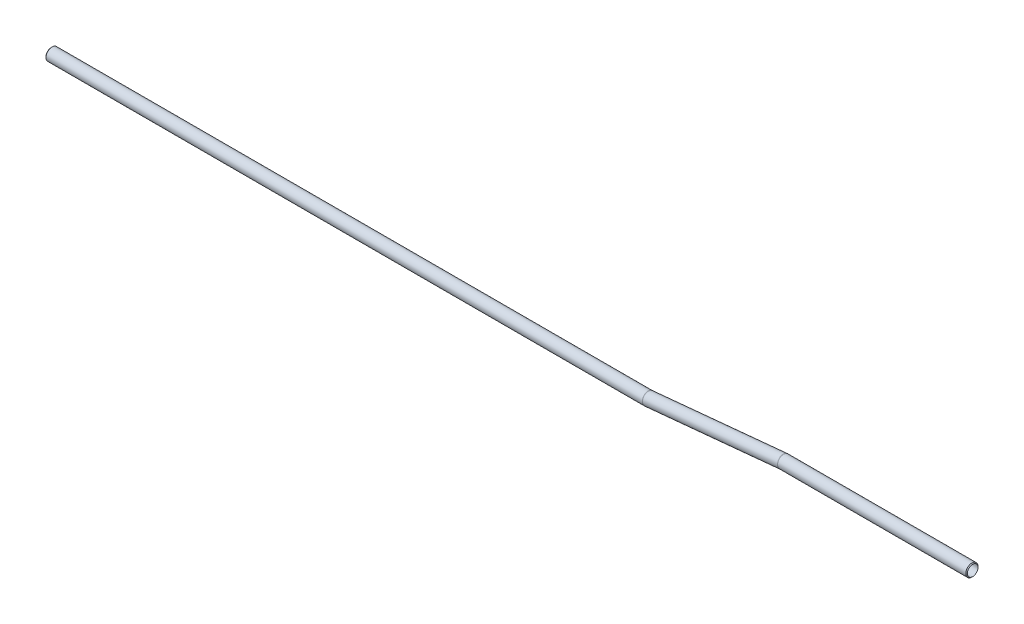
ISO-10303-21;
HEADER;
FILE_DESCRIPTION(('STEP AP214'),'2;1');
FILE_NAME('part.step','',(''),(''),'','','');
FILE_SCHEMA(('AUTOMOTIVE_DESIGN { 1 0 10303 214 1 1 1 1 }'));
ENDSEC;
DATA;
#1=APPLICATION_CONTEXT('core data for automotive mechanical design processes');
#2=APPLICATION_PROTOCOL_DEFINITION('international standard','automotive_design',2000,#1);
#3=PRODUCT_CONTEXT('',#1,'mechanical');
#4=PRODUCT('Part','Part','',(#3));
#5=PRODUCT_RELATED_PRODUCT_CATEGORY('part','',(#4));
#6=PRODUCT_DEFINITION_FORMATION('','',#4);
#7=PRODUCT_DEFINITION_CONTEXT('part definition',#1,'design');
#8=PRODUCT_DEFINITION('design','',#6,#7);
#9=PRODUCT_DEFINITION_SHAPE('','',#8);
#10=(LENGTH_UNIT() NAMED_UNIT(*) SI_UNIT(.MILLI.,.METRE.));
#11=(NAMED_UNIT(*) PLANE_ANGLE_UNIT() SI_UNIT($,.RADIAN.));
#12=(NAMED_UNIT(*) SI_UNIT($,.STERADIAN.) SOLID_ANGLE_UNIT());
#13=UNCERTAINTY_MEASURE_WITH_UNIT(LENGTH_MEASURE(1.E-05),#10,'distance_accuracy_value','');
#14=(GEOMETRIC_REPRESENTATION_CONTEXT(3) GLOBAL_UNCERTAINTY_ASSIGNED_CONTEXT((#13)) GLOBAL_UNIT_ASSIGNED_CONTEXT((#10,
#11,#12)) REPRESENTATION_CONTEXT('',''));
#15=CARTESIAN_POINT('',(0.,0.,0.));
#16=DIRECTION('',(0.,0.,1.));
#17=DIRECTION('',(1.,0.,0.));
#18=AXIS2_PLACEMENT_3D('',#15,#16,#17);
#19=CARTESIAN_POINT('',(-117.096200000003,-5.48204999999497,0.));
#20=DIRECTION('',(-1.,0.,0.));
#21=DIRECTION('',(0.,0.,1.));
#22=AXIS2_PLACEMENT_3D('',#19,#20,#21);
#23=CYLINDRICAL_SURFACE('',#22,2.58475);
#24=CARTESIAN_POINT('',(-369.096200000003,-5.48204999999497,0.));
#25=DIRECTION('',(-1.,0.,0.));
#26=DIRECTION('',(0.,0.,1.));
#27=AXIS2_PLACEMENT_3D('',#24,#25,#26);
#28=CIRCLE('',#27,2.58475);
#29=CARTESIAN_POINT('',(-369.096200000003,-5.48204999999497,2.58475));
#30=VERTEX_POINT('',#29);
#31=EDGE_CURVE('E156',#30,#30,#28,.F.);
#32=ORIENTED_EDGE('',*,*,#31,.T.);
#33=EDGE_LOOP('',(#32));
#34=FACE_BOUND('',#33,.T.);
#35=CARTESIAN_POINT('',(-117.096200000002,-5.48204999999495,0.));
#36=DIRECTION('',(0.996410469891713,0.0846532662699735,0.));
#37=DIRECTION('',(0.0846532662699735,-0.996410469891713,0.));
#38=AXIS2_PLACEMENT_3D('',#35,#36,#37);
#39=ELLIPSE('',#38,2.59406146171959,2.58475);
#40=CARTESIAN_POINT('',(-117.096200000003,-5.48204999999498,2.58475));
#41=VERTEX_POINT('',#40);
#42=CARTESIAN_POINT('',(-117.096200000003,-5.48204999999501,-2.58475));
#43=VERTEX_POINT('',#42);
#44=EDGE_CURVE('E50',#41,#43,#39,.F.);
#45=ORIENTED_EDGE('',*,*,#44,.T.);
#46=CARTESIAN_POINT('',(-117.096200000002,-5.48204999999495,0.));
#47=DIRECTION('',(0.999941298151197,0.0108351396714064,0.));
#48=DIRECTION('',(0.0108351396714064,-0.999941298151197,0.));
#49=AXIS2_PLACEMENT_3D('',#46,#47,#48);
#50=ELLIPSE('',#49,2.58490173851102,2.58475);
#51=EDGE_CURVE('E12',#43,#41,#50,.F.);
#52=ORIENTED_EDGE('',*,*,#51,.T.);
#53=EDGE_LOOP('',(#45,#52));
#54=FACE_BOUND('',#53,.T.);
#55=ADVANCED_FACE('F37',(#34,#54),#23,.T.);
#56=CARTESIAN_POINT('',(-117.096200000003,-5.48204999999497,0.));
#57=DIRECTION('',(-1.,0.,0.));
#58=DIRECTION('',(0.,0.,1.));
#59=AXIS2_PLACEMENT_3D('',#56,#57,#58);
#60=CYLINDRICAL_SURFACE('',#59,2.25);
#61=CARTESIAN_POINT('',(-369.430950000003,-5.48204999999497,0.));
#62=DIRECTION('',(1.,0.,0.));
#63=DIRECTION('',(0.,0.,-1.));
#64=AXIS2_PLACEMENT_3D('',#61,#62,#63);
#65=CIRCLE('',#64,2.25);
#66=CARTESIAN_POINT('',(-369.430950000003,-5.48204999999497,-2.25));
#67=VERTEX_POINT('',#66);
#68=EDGE_CURVE('E158',#67,#67,#65,.F.);
#69=ORIENTED_EDGE('',*,*,#68,.T.);
#70=EDGE_LOOP('',(#69));
#71=FACE_BOUND('',#70,.T.);
#72=CARTESIAN_POINT('',(-117.096200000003,-5.48204999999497,0.));
#73=DIRECTION('',(-0.998854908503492,-0.0478421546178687,0.));
#74=DIRECTION('',(0.0478421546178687,-0.998854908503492,0.));
#75=AXIS2_PLACEMENT_3D('',#72,#73,#74);
#76=ELLIPSE('',#75,2.25257940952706,2.25);
#77=CARTESIAN_POINT('',(-116.988431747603,-7.73204999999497,0.));
#78=VERTEX_POINT('',#77);
#79=EDGE_CURVE('E161',#78,#78,#76,.F.);
#80=ORIENTED_EDGE('',*,*,#79,.T.);
#81=EDGE_LOOP('',(#80));
#82=FACE_BOUND('',#81,.T.);
#83=ADVANCED_FACE('F118',(#71,#82),#60,.F.);
#84=CARTESIAN_POINT('',(-60.0000000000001,0.,0.));
#85=DIRECTION('',(-0.99542225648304,-0.0955747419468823,0.));
#86=DIRECTION('',(0.0955747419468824,-0.99542225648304,0.));
#87=AXIS2_PLACEMENT_3D('',#84,#85,#86);
#88=CYLINDRICAL_SURFACE('',#87,2.25);
#89=CARTESIAN_POINT('',(-60.0000000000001,0.,0.));
#90=DIRECTION('',(-0.998854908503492,-0.0478421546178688,0.));
#91=DIRECTION('',(-0.0478421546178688,0.998854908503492,0.));
#92=AXIS2_PLACEMENT_3D('',#89,#90,#91);
#93=ELLIPSE('',#92,2.25257940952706,2.25);
#94=CARTESIAN_POINT('',(-60.1077682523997,2.24999999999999,0.));
#95=VERTEX_POINT('',#94);
#96=EDGE_CURVE('E162',#95,#95,#93,.T.);
#97=ORIENTED_EDGE('',*,*,#96,.F.);
#98=EDGE_LOOP('',(#97));
#99=FACE_BOUND('',#98,.T.);
#100=ORIENTED_EDGE('',*,*,#79,.F.);
#101=EDGE_LOOP('',(#100));
#102=FACE_BOUND('',#101,.T.);
#103=ADVANCED_FACE('F115',(#99,#102),#88,.F.);
#104=CARTESIAN_POINT('',(-60.0000000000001,0.,0.));
#105=DIRECTION('',(-0.99542225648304,-0.0955747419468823,0.));
#106=DIRECTION('',(0.0955747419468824,-0.99542225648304,0.));
#107=AXIS2_PLACEMENT_3D('',#104,#105,#106);
#108=CYLINDRICAL_SURFACE('',#107,2.58475);
#109=CARTESIAN_POINT('',(-60.0000000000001,0.,0.));
#110=DIRECTION('',(0.996399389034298,0.084783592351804,0.));
#111=DIRECTION('',(0.084783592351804,-0.996399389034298,0.));
#112=AXIS2_PLACEMENT_3D('',#109,#110,#111);
#113=ELLIPSE('',#112,2.58490173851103,2.58475);
#114=CARTESIAN_POINT('',(-60.0000000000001,0.,2.58475));
#115=VERTEX_POINT('',#114);
#116=CARTESIAN_POINT('',(-60.0000000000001,0.,-2.58475));
#117=VERTEX_POINT('',#116);
#118=EDGE_CURVE('E73',#115,#117,#113,.F.);
#119=ORIENTED_EDGE('',*,*,#118,.T.);
#120=CARTESIAN_POINT('',(-60.0000000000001,0.,0.));
#121=DIRECTION('',(0.999939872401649,0.0109659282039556,0.));
#122=DIRECTION('',(0.0109659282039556,-0.999939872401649,0.));
#123=AXIS2_PLACEMENT_3D('',#120,#121,#122);
#124=ELLIPSE('',#123,2.59406146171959,2.58475);
#125=EDGE_CURVE('E81',#117,#115,#124,.F.);
#126=ORIENTED_EDGE('',*,*,#125,.T.);
#127=EDGE_LOOP('',(#119,#126));
#128=FACE_BOUND('',#127,.T.);
#129=CARTESIAN_POINT('',(-117.096200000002,-5.48204999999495,0.));
#130=DIRECTION('',(0.996399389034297,0.084783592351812,0.));
#131=DIRECTION('',(0.0847835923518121,-0.996399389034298,0.));
#132=AXIS2_PLACEMENT_3D('',#129,#130,#131);
#133=ELLIPSE('',#132,2.58490173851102,2.58475);
#134=EDGE_CURVE('E147',#41,#43,#133,.T.);
#135=ORIENTED_EDGE('',*,*,#134,.T.);
#136=CARTESIAN_POINT('',(-117.096200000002,-5.48204999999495,0.));
#137=DIRECTION('',(0.999939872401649,0.0109659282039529,0.));
#138=DIRECTION('',(0.0109659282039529,-0.999939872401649,0.));
#139=AXIS2_PLACEMENT_3D('',#136,#137,#138);
#140=ELLIPSE('',#139,2.59406146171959,2.58475);
#141=EDGE_CURVE('E86',#43,#41,#140,.T.);
#142=ORIENTED_EDGE('',*,*,#141,.T.);
#143=EDGE_LOOP('',(#135,#142));
#144=FACE_BOUND('',#143,.T.);
#145=ADVANCED_FACE('F84',(#128,#144),#108,.T.);
#146=CARTESIAN_POINT('',(0.,0.,0.));
#147=DIRECTION('',(-1.,0.,0.));
#148=DIRECTION('',(0.,-1.,0.));
#149=AXIS2_PLACEMENT_3D('',#146,#147,#148);
#150=CYLINDRICAL_SURFACE('',#149,2.25);
#151=CARTESIAN_POINT('',(19.8347499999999,0.,0.));
#152=DIRECTION('',(-1.,0.,0.));
#153=DIRECTION('',(0.,-1.,0.));
#154=AXIS2_PLACEMENT_3D('',#151,#152,#153);
#155=CIRCLE('',#154,2.25);
#156=CARTESIAN_POINT('',(19.8347499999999,-2.25,0.));
#157=VERTEX_POINT('',#156);
#158=EDGE_CURVE('E153',#157,#157,#155,.F.);
#159=ORIENTED_EDGE('',*,*,#158,.T.);
#160=EDGE_LOOP('',(#159));
#161=FACE_BOUND('',#160,.T.);
#162=ORIENTED_EDGE('',*,*,#96,.T.);
#163=EDGE_LOOP('',(#162));
#164=FACE_BOUND('',#163,.T.);
#165=ADVANCED_FACE('F113',(#161,#164),#150,.F.);
#166=CARTESIAN_POINT('',(0.,0.,0.));
#167=DIRECTION('',(-1.,0.,0.));
#168=DIRECTION('',(0.,-1.,0.));
#169=AXIS2_PLACEMENT_3D('',#166,#167,#168);
#170=CYLINDRICAL_SURFACE('',#169,2.58475);
#171=CARTESIAN_POINT('',(19.4999999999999,0.,0.));
#172=DIRECTION('',(1.,0.,0.));
#173=DIRECTION('',(0.,1.,0.));
#174=AXIS2_PLACEMENT_3D('',#171,#172,#173);
#175=CIRCLE('',#174,2.58475);
#176=CARTESIAN_POINT('',(19.4999999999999,2.58475,0.));
#177=VERTEX_POINT('',#176);
#178=EDGE_CURVE('E148',#177,#177,#175,.F.);
#179=ORIENTED_EDGE('',*,*,#178,.T.);
#180=EDGE_LOOP('',(#179));
#181=FACE_BOUND('',#180,.T.);
#182=CARTESIAN_POINT('',(-60.0000000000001,0.,0.));
#183=DIRECTION('',(0.996410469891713,0.0846532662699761,0.));
#184=DIRECTION('',(0.0846532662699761,-0.996410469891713,0.));
#185=AXIS2_PLACEMENT_3D('',#182,#183,#184);
#186=ELLIPSE('',#185,2.59406146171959,2.58475);
#187=EDGE_CURVE('E76',#115,#117,#186,.T.);
#188=ORIENTED_EDGE('',*,*,#187,.T.);
#189=CARTESIAN_POINT('',(-60.0000000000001,0.,0.));
#190=DIRECTION('',(0.999941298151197,0.0108351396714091,0.));
#191=DIRECTION('',(0.0108351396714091,-0.999941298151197,0.));
#192=AXIS2_PLACEMENT_3D('',#189,#190,#191);
#193=ELLIPSE('',#192,2.58490173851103,2.58475);
#194=EDGE_CURVE('E69',#117,#115,#193,.T.);
#195=ORIENTED_EDGE('',*,*,#194,.T.);
#196=EDGE_LOOP('',(#188,#195));
#197=FACE_BOUND('',#196,.T.);
#198=ADVANCED_FACE('F78',(#181,#197),#170,.T.);
#199=CARTESIAN_POINT('',(-369.596200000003,-5.48204999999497,0.));
#200=DIRECTION('',(1.,0.,0.));
#201=DIRECTION('',(0.,0.,-1.));
#202=AXIS2_PLACEMENT_3D('',#199,#200,#201);
#203=CONICAL_SURFACE('',#202,2.08474999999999,0.785398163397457);
#204=ORIENTED_EDGE('',*,*,#31,.F.);
#205=EDGE_LOOP('',(#204));
#206=FACE_BOUND('',#205,.T.);
#207=ORIENTED_EDGE('',*,*,#68,.F.);
#208=EDGE_LOOP('',(#207));
#209=FACE_BOUND('',#208,.T.);
#210=ADVANCED_FACE('F112',(#206,#209),#203,.T.);
#211=CARTESIAN_POINT('',(19.9999999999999,0.,0.));
#212=DIRECTION('',(-1.,0.,0.));
#213=DIRECTION('',(0.,-1.,0.));
#214=AXIS2_PLACEMENT_3D('',#211,#212,#213);
#215=CONICAL_SURFACE('',#214,2.08474999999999,0.785398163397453);
#216=ORIENTED_EDGE('',*,*,#178,.F.);
#217=EDGE_LOOP('',(#216));
#218=FACE_BOUND('',#217,.T.);
#219=ORIENTED_EDGE('',*,*,#158,.F.);
#220=EDGE_LOOP('',(#219));
#221=FACE_BOUND('',#220,.T.);
#222=ADVANCED_FACE('F103',(#218,#221),#215,.T.);
#223=CARTESIAN_POINT('',(-60.0000000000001,0.,-2.58475));
#224=CARTESIAN_POINT('',(-60.0000000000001,0.,-2.58475));
#225=CARTESIAN_POINT('',(-60.0000000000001,0.,-2.58475));
#226=CARTESIAN_POINT('',(-59.9987587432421,-0.113185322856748,-2.58479465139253));
#227=CARTESIAN_POINT('',(-59.9945882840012,-0.112986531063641,-2.58479669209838));
#228=CARTESIAN_POINT('',(-59.9904179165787,-0.112785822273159,-2.58479465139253));
#229=CARTESIAN_POINT('',(-59.997517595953,-0.226360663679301,-2.57737011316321));
#230=CARTESIAN_POINT('',(-59.9891770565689,-0.22596286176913,-2.57734394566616));
#231=CARTESIAN_POINT('',(-59.9808366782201,-0.225561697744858,-2.57737011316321));
#232=CARTESIAN_POINT('',(-59.9950564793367,-0.450780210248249,-2.54790466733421));
#233=CARTESIAN_POINT('',(-59.9784479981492,-0.449965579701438,-2.54777579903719));
#234=CARTESIAN_POINT('',(-59.9618376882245,-0.449189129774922,-2.54790466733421));
#235=CARTESIAN_POINT('',(-59.9938365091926,-0.562024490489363,-2.52586432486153));
#236=CARTESIAN_POINT('',(-59.9731300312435,-0.560994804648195,-2.52566021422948));
#237=CARTESIAN_POINT('',(-59.9524199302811,-0.560040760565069,-2.52586432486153));
#238=CARTESIAN_POINT('',(-59.9914386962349,-0.780671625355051,-2.46749141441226));
#239=CARTESIAN_POINT('',(-59.9626796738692,-0.779178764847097,-2.46710157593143));
#240=CARTESIAN_POINT('',(-59.9339096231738,-0.77791615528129,-2.46749141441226));
#241=CARTESIAN_POINT('',(-59.9902608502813,-0.888074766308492,-2.4311599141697));
#242=CARTESIAN_POINT('',(-59.9575471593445,-0.88633609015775,-2.43065820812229));
#243=CARTESIAN_POINT('',(-59.9248170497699,-0.884940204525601,-2.4311599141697));
#244=CARTESIAN_POINT('',(-59.9879674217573,-1.09720349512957,-2.34483988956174));
#245=CARTESIAN_POINT('',(-59.9475559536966,-1.09493381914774,-2.34409940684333));
#246=CARTESIAN_POINT('',(-59.9071125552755,-1.09333078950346,-2.34483988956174));
#247=CARTESIAN_POINT('',(-59.9868518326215,-1.19892968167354,-2.29485280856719));
#248=CARTESIAN_POINT('',(-59.9426971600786,-1.19637636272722,-2.29398364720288));
#249=CARTESIAN_POINT('',(-59.8985005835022,-1.19469792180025,-2.29485280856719));
#250=CARTESIAN_POINT('',(-59.9847020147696,-1.39496311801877,-2.18207281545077));
#251=CARTESIAN_POINT('',(-59.9333367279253,-1.39180471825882,-2.18095374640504));
#252=CARTESIAN_POINT('',(-59.8819047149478,-1.39003943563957,-2.18207281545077));
#253=CARTESIAN_POINT('',(-59.9836677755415,-1.48927132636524,-2.11928156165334));
#254=CARTESIAN_POINT('',(-59.9288350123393,-1.48579213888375,-2.11803940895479));
#255=CARTESIAN_POINT('',(-59.8739207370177,-1.48401477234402,-2.11928156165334));
#256=CARTESIAN_POINT('',(-59.9816983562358,-1.66885492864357,-1.98196844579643));
#257=CARTESIAN_POINT('',(-59.9202655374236,-1.66470678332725,-1.98050989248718));
#258=CARTESIAN_POINT('',(-59.8587174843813,-1.6629645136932,-1.98196844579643));
#259=CARTESIAN_POINT('',(-59.9807631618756,-1.75413162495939,-1.9074482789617));
#260=CARTESIAN_POINT('',(-59.9161977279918,-1.74963505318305,-1.90589480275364));
#261=CARTESIAN_POINT('',(-59.8514980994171,-1.74794021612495,-1.9074482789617));
#262=CARTESIAN_POINT('',(-59.9790078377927,-1.91419272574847,-1.7479521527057));
#263=CARTESIAN_POINT('',(-59.908565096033,-1.90899016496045,-1.7462569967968));
#264=CARTESIAN_POINT('',(-59.837947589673,-1.90743636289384,-1.7479521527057));
#265=CARTESIAN_POINT('',(-59.9781876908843,-1.98897869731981,-1.66297775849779));
#266=CARTESIAN_POINT('',(-59.905000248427,-1.98341753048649,-1.66123479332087));
#267=CARTESIAN_POINT('',(-59.831616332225,-1.98195836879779,-1.66297775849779));
#268=CARTESIAN_POINT('',(-59.9766764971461,-2.12677851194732,-1.4840273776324));
#269=CARTESIAN_POINT('',(-59.8984336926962,-2.12051496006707,-1.48224862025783));
#270=CARTESIAN_POINT('',(-59.8199504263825,-2.11927180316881,-1.4840273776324));
#271=CARTESIAN_POINT('',(-59.9759854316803,-2.18979405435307,-1.39005269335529));
#272=CARTESIAN_POINT('',(-59.8954319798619,-2.18318512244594,-1.38828568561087));
#273=CARTESIAN_POINT('',(-59.8146156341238,-2.1820649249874,-1.39005269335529));
#274=CARTESIAN_POINT('',(-59.9747442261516,-2.30297470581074,-1.19470996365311));
#275=CARTESIAN_POINT('',(-59.8900420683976,-2.29571641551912,-1.19302929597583));
#276=CARTESIAN_POINT('',(-59.8050339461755,-2.29484609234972,-1.19470996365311));
#277=CARTESIAN_POINT('',(-59.9741940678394,-2.35314147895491,-1.09334287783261));
#278=CARTESIAN_POINT('',(-59.887653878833,-2.34557735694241,-1.09173743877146));
#279=CARTESIAN_POINT('',(-59.8007869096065,-2.34483579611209,-1.09334287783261));
#280=CARTESIAN_POINT('',(-59.9732440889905,-2.43976631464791,-0.884950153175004));
#281=CARTESIAN_POINT('',(-59.8835308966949,-2.43165752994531,-0.883551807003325));
#282=CARTESIAN_POINT('',(-59.7934533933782,-2.43115487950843,-0.884950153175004));
#283=CARTESIAN_POINT('',(-59.9728442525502,-2.47622582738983,-0.777925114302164));
#284=CARTESIAN_POINT('',(-59.8817961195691,-2.46787643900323,-0.776660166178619));
#285=CARTESIAN_POINT('',(-59.790366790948,-2.46748570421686,-0.777925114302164));
#286=CARTESIAN_POINT('',(-59.9722017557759,-2.5348125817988,-0.560048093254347));
#287=CARTESIAN_POINT('',(-59.8790088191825,-2.52607006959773,-0.559091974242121));
#288=CARTESIAN_POINT('',(-59.7854069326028,-2.52586566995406,-0.560048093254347));
#289=CARTESIAN_POINT('',(-59.9719590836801,-2.55694089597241,-0.449196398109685));
#290=CARTESIAN_POINT('',(-59.877956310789,-2.54804448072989,-0.448417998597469));
#291=CARTESIAN_POINT('',(-59.7835335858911,-2.54791587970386,-0.449196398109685));
#292=CARTESIAN_POINT('',(-59.9716350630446,-2.58648706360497,-0.2255630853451));
#293=CARTESIAN_POINT('',(-59.8765510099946,-2.57738453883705,-0.225161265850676));
#294=CARTESIAN_POINT('',(-59.7810322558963,-2.57735776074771,-0.2255630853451));
#295=CARTESIAN_POINT('',(-59.9715537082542,-2.59390548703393,-0.11278154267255));
#296=CARTESIAN_POINT('',(-59.8761982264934,-2.58475000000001,-0.112581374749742));
#297=CARTESIAN_POINT('',(-59.7804042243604,-2.58475000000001,-0.11278154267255));
#298=CARTESIAN_POINT('',(-59.9715537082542,-2.59390548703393,0.11278154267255));
#299=CARTESIAN_POINT('',(-59.8761982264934,-2.58475000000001,0.112581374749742));
#300=CARTESIAN_POINT('',(-59.7804042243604,-2.58475000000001,0.11278154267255));
#301=CARTESIAN_POINT('',(-59.9716350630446,-2.58648706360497,0.225563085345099));
#302=CARTESIAN_POINT('',(-59.8765510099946,-2.57738453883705,0.225161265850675));
#303=CARTESIAN_POINT('',(-59.7810322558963,-2.57735776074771,0.2255630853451));
#304=CARTESIAN_POINT('',(-59.9719590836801,-2.55694089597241,0.449196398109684));
#305=CARTESIAN_POINT('',(-59.877956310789,-2.54804448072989,0.448417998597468));
#306=CARTESIAN_POINT('',(-59.7835335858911,-2.54791587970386,0.449196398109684));
#307=CARTESIAN_POINT('',(-59.9722017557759,-2.5348125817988,0.560048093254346));
#308=CARTESIAN_POINT('',(-59.8790088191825,-2.52607006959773,0.559091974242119));
#309=CARTESIAN_POINT('',(-59.7854069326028,-2.52586566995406,0.560048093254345));
#310=CARTESIAN_POINT('',(-59.9728442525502,-2.47622582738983,0.777925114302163));
#311=CARTESIAN_POINT('',(-59.8817961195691,-2.46787643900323,0.776660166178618));
#312=CARTESIAN_POINT('',(-59.790366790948,-2.46748570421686,0.777925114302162));
#313=CARTESIAN_POINT('',(-59.9732440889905,-2.43976631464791,0.884950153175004));
#314=CARTESIAN_POINT('',(-59.8835308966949,-2.43165752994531,0.883551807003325));
#315=CARTESIAN_POINT('',(-59.7934533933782,-2.43115487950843,0.884950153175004));
#316=CARTESIAN_POINT('',(-59.9741940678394,-2.35314147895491,1.09334287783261));
#317=CARTESIAN_POINT('',(-59.887653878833,-2.34557735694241,1.09173743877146));
#318=CARTESIAN_POINT('',(-59.8007869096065,-2.34483579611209,1.09334287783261));
#319=CARTESIAN_POINT('',(-59.9747442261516,-2.30297470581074,1.1947099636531));
#320=CARTESIAN_POINT('',(-59.8900420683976,-2.29571641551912,1.19302929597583));
#321=CARTESIAN_POINT('',(-59.8050339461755,-2.29484609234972,1.1947099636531));
#322=CARTESIAN_POINT('',(-59.9759854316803,-2.18979405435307,1.39005269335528));
#323=CARTESIAN_POINT('',(-59.8954319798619,-2.18318512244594,1.38828568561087));
#324=CARTESIAN_POINT('',(-59.8146156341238,-2.18206492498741,1.39005269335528));
#325=CARTESIAN_POINT('',(-59.9766764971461,-2.12677851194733,1.4840273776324));
#326=CARTESIAN_POINT('',(-59.8984336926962,-2.12051496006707,1.48224862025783));
#327=CARTESIAN_POINT('',(-59.8199504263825,-2.11927180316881,1.4840273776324));
#328=CARTESIAN_POINT('',(-59.9781876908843,-1.98897869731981,1.66297775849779));
#329=CARTESIAN_POINT('',(-59.905000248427,-1.98341753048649,1.66123479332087));
#330=CARTESIAN_POINT('',(-59.831616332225,-1.98195836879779,1.66297775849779));
#331=CARTESIAN_POINT('',(-59.9790078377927,-1.91419272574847,1.7479521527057));
#332=CARTESIAN_POINT('',(-59.908565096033,-1.90899016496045,1.7462569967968));
#333=CARTESIAN_POINT('',(-59.837947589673,-1.90743636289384,1.7479521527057));
#334=CARTESIAN_POINT('',(-59.9807631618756,-1.75413162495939,1.9074482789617));
#335=CARTESIAN_POINT('',(-59.9161977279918,-1.74963505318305,1.90589480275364));
#336=CARTESIAN_POINT('',(-59.8514980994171,-1.74794021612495,1.9074482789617));
#337=CARTESIAN_POINT('',(-59.9816983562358,-1.66885492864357,1.98196844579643));
#338=CARTESIAN_POINT('',(-59.9202655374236,-1.66470678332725,1.98050989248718));
#339=CARTESIAN_POINT('',(-59.8587174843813,-1.6629645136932,1.98196844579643));
#340=CARTESIAN_POINT('',(-59.9836677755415,-1.48927132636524,2.11928156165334));
#341=CARTESIAN_POINT('',(-59.9288350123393,-1.48579213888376,2.11803940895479));
#342=CARTESIAN_POINT('',(-59.8739207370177,-1.48401477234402,2.11928156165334));
#343=CARTESIAN_POINT('',(-59.9847020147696,-1.39496311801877,2.18207281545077));
#344=CARTESIAN_POINT('',(-59.9333367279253,-1.39180471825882,2.18095374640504));
#345=CARTESIAN_POINT('',(-59.8819047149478,-1.39003943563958,2.18207281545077));
#346=CARTESIAN_POINT('',(-59.9868518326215,-1.19892968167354,2.29485280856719));
#347=CARTESIAN_POINT('',(-59.9426971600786,-1.19637636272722,2.29398364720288));
#348=CARTESIAN_POINT('',(-59.8985005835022,-1.19469792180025,2.29485280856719));
#349=CARTESIAN_POINT('',(-59.9879674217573,-1.09720349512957,2.34483988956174));
#350=CARTESIAN_POINT('',(-59.9475559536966,-1.09493381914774,2.34409940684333));
#351=CARTESIAN_POINT('',(-59.9071125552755,-1.09333078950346,2.34483988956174));
#352=CARTESIAN_POINT('',(-59.9902608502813,-0.888074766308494,2.4311599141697));
#353=CARTESIAN_POINT('',(-59.9575471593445,-0.886336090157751,2.43065820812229));
#354=CARTESIAN_POINT('',(-59.9248170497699,-0.884940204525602,2.4311599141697));
#355=CARTESIAN_POINT('',(-59.9914386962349,-0.780671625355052,2.46749141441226));
#356=CARTESIAN_POINT('',(-59.9626796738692,-0.779178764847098,2.46710157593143));
#357=CARTESIAN_POINT('',(-59.9339096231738,-0.777916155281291,2.46749141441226));
#358=CARTESIAN_POINT('',(-59.9938365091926,-0.562024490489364,2.52586432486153));
#359=CARTESIAN_POINT('',(-59.9731300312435,-0.560994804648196,2.52566021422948));
#360=CARTESIAN_POINT('',(-59.9524199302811,-0.56004076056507,2.52586432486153));
#361=CARTESIAN_POINT('',(-59.9950564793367,-0.45078021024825,2.54790466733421));
#362=CARTESIAN_POINT('',(-59.9784479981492,-0.44996557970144,2.54777579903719));
#363=CARTESIAN_POINT('',(-59.9618376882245,-0.449189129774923,2.54790466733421));
#364=CARTESIAN_POINT('',(-59.997517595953,-0.226360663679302,2.57737011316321));
#365=CARTESIAN_POINT('',(-59.9891770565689,-0.225962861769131,2.57734394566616));
#366=CARTESIAN_POINT('',(-59.9808366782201,-0.225561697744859,2.57737011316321));
#367=CARTESIAN_POINT('',(-59.9987587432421,-0.113185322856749,2.58479465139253));
#368=CARTESIAN_POINT('',(-59.9945882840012,-0.112986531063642,2.58479669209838));
#369=CARTESIAN_POINT('',(-59.9904179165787,-0.11278582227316,2.58479465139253));
#370=CARTESIAN_POINT('',(-60.0000000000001,0.,2.58475));
#371=CARTESIAN_POINT('',(-60.0000000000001,0.,2.58475));
#372=CARTESIAN_POINT('',(-60.0000000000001,0.,2.58475));
#373=(BOUNDED_SURFACE() B_SPLINE_SURFACE(3,2,((#223,#224,#225),(#226,#227,#228),(#229,#230,
#231),(#232,#233,#234),(#235,#236,#237),(#238,#239,#240),(#241,#242,#243),(#244,#245,#246),
(#247,#248,#249),(#250,#251,#252),(#253,#254,#255),(#256,#257,#258),(#259,#260,#261),(#262,#263,
#264),(#265,#266,#267),(#268,#269,#270),(#271,#272,#273),(#274,#275,#276),(#277,#278,#279),
(#280,#281,#282),(#283,#284,#285),(#286,#287,#288),(#289,#290,#291),(#292,#293,#294),(#295,#296,
#297),(#298,#299,#300),(#301,#302,#303),(#304,#305,#306),(#307,#308,#309),(#310,#311,#312),
(#313,#314,#315),(#316,#317,#318),(#319,#320,#321),(#322,#323,#324),(#325,#326,#327),(#328,#329,
#330),(#331,#332,#333),(#334,#335,#336),(#337,#338,#339),(#340,#341,#342),(#343,#344,#345),
(#346,#347,#348),(#349,#350,#351),(#352,#353,#354),(#355,#356,#357),(#358,#359,#360),(#361,#362,
#363),(#364,#365,#366),(#367,#368,#369),(#370,#371,#372)),.UNSPECIFIED.,.F.,.F.,
.F.) B_SPLINE_SURFACE_WITH_KNOTS((4,2,2,2,2,2,2,2,2,2,2,2,2,2,2,2,2,2,2,2,2,2,2,2,4),(3,3),(0.,
0.600398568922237,1.20077392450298,1.80110443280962,2.40137151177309,3.00156089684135,
3.60166361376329,4.20167659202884,4.8016028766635,5.40145142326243,6.00123648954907,
6.60097666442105,7.20069360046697,7.8004105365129,8.40015071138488,8.99993577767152,
9.59978432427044,10.1997106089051,10.7997235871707,11.3998263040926,12.0000156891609,
12.6002827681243,13.200613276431,13.8009886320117,14.4013872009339),(0.,1.),
.UNSPECIFIED.) GEOMETRIC_REPRESENTATION_ITEM() RATIONAL_B_SPLINE_SURFACE(((1.,1.,1.),(1.,
1.00000015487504,1.),(1.,0.999993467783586,1.),(1.,0.999967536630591,1.),(1.,0.999948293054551,
1.),(1.,0.999898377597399,1.),(1.,0.999867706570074,1.),(1.,0.99979707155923,1.),(1.,
0.999757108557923,1.),(1.,0.999670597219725,1.),(1.,0.999624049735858,1.),(1.,0.999527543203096,
1.),(1.,0.999477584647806,1.),(1.,0.999377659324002,1.),(1.,0.999327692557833,1.),(1.,
0.999231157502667,1.),(1.,0.99918458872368,1.),(1.,0.999098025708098,1.),(1.,0.999058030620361,
1.),(1.,0.998987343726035,1.),(1.,0.998956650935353,1.),(1.,0.998906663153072,1.),(1.,
0.998887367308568,1.),(1.,0.998861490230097,1.),(1.,0.998854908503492,1.),(1.,0.998854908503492,
1.),(1.,0.998861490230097,1.),(1.,0.998887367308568,1.),(1.,0.998906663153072,1.),(1.,
0.998956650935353,1.),(1.,0.998987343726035,1.),(1.,0.999058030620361,1.),(1.,0.999098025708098,
1.),(1.,0.999184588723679,1.),(1.,0.999231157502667,1.),(1.,0.999327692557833,1.),(1.,
0.999377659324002,1.),(1.,0.999477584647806,1.),(1.,0.999527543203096,1.),(1.,0.999624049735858,
1.),(1.,0.999670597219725,1.),(1.,0.999757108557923,1.),(1.,0.99979707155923,1.),(1.,
0.999867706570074,1.),(1.,0.999898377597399,1.),(1.,0.999948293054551,1.),(1.,0.999967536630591,
1.),(1.,0.999993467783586,1.),(1.,1.00000015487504,1.),(1.,1.,1.))) REPRESENTATION_ITEM('') SURFACE());
#374=ORIENTED_EDGE('',*,*,#125,.F.);
#375=ORIENTED_EDGE('',*,*,#187,.F.);
#376=EDGE_LOOP('',(#374,#375));
#377=FACE_BOUND('',#376,.T.);
#378=ADVANCED_FACE('F88',(#377),#373,.F.);
#379=CARTESIAN_POINT('',(-60.0000000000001,0.,2.58475));
#380=CARTESIAN_POINT('',(-60.0000000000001,0.,2.58475));
#381=CARTESIAN_POINT('',(-60.0000000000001,0.,2.58475));
#382=CARTESIAN_POINT('',(-60.0012221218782,0.112785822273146,2.58479465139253));
#383=CARTESIAN_POINT('',(-60.0053925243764,0.112585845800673,2.58479372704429));
#384=CARTESIAN_POINT('',(-60.0095629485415,0.112386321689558,2.58479465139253));
#385=CARTESIAN_POINT('',(-60.0024441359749,0.225561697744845,2.57737011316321));
#386=CARTESIAN_POINT('',(-60.0107846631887,0.225163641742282,2.57739619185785));
#387=CARTESIAN_POINT('',(-60.0191250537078,0.224762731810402,2.57737011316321));
#388=CARTESIAN_POINT('',(-60.0048673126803,0.449189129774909,2.54790466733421));
#389=CARTESIAN_POINT('',(-60.0214777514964,0.44841537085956,2.5480328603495));
#390=CARTESIAN_POINT('',(-60.0380861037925,0.447598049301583,2.54790466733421));
#391=CARTESIAN_POINT('',(-60.0060684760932,0.560040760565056,2.52586432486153));
#392=CARTESIAN_POINT('',(-60.0267788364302,0.559092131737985,2.52606688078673));
#393=CARTESIAN_POINT('',(-60.0474850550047,0.558057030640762,2.52586432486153));
#394=CARTESIAN_POINT('',(-60.0084293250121,0.777916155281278,2.46749141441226));
#395=CARTESIAN_POINT('',(-60.0371996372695,0.776659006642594,2.46787989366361));
#396=CARTESIAN_POINT('',(-60.0659583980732,0.775160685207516,2.46749141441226));
#397=CARTESIAN_POINT('',(-60.0095890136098,0.884940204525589,2.4311599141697));
#398=CARTESIAN_POINT('',(-60.0423194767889,0.883551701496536,2.43165857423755));
#399=CARTESIAN_POINT('',(-60.0750328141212,0.881805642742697,2.4311599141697));
#400=CARTESIAN_POINT('',(-60.0118470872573,1.09333078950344,2.34483988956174));
#401=CARTESIAN_POINT('',(-60.0522908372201,1.09173509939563,2.34557732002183));
#402=CARTESIAN_POINT('',(-60.0927019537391,1.08945808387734,2.34483988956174));
#403=CARTESIAN_POINT('',(-60.0129454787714,1.19469792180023,2.29485280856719));
#404=CARTESIAN_POINT('',(-60.0571424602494,1.19302793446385,2.29571706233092));
#405=CARTESIAN_POINT('',(-60.1012967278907,1.19046616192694,2.29485280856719));
#406=CARTESIAN_POINT('',(-60.0150621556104,1.39003943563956,2.18207281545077));
#407=CARTESIAN_POINT('',(-60.0664945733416,1.3882826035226,2.18318703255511));
#408=CARTESIAN_POINT('',(-60.1178594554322,1.38511575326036,2.18207281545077));
#409=CARTESIAN_POINT('',(-60.0160804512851,1.48401477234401,2.11928156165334));
#410=CARTESIAN_POINT('',(-60.0709951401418,1.48224603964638,2.12051706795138));
#411=CARTESIAN_POINT('',(-60.1258274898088,1.47875821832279,2.11928156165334));
#412=CARTESIAN_POINT('',(-60.0180195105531,1.66296451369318,1.98196844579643));
#413=CARTESIAN_POINT('',(-60.0795679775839,1.66123088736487,1.9834203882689));
#414=CARTESIAN_POINT('',(-60.1410003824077,1.65707409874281,1.98196844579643));
#415=CARTESIAN_POINT('',(-60.018940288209,1.74794021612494,1.9074482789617));
#416=CARTESIAN_POINT('',(-60.0836402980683,1.74625333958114,1.90899376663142));
#417=CARTESIAN_POINT('',(-60.1482053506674,1.74174880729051,1.9074482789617));
#418=CARTESIAN_POINT('',(-60.0206685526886,1.90743636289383,1.7479521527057));
#419=CARTESIAN_POINT('',(-60.0912864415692,1.90589054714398,1.74963935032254));
#420=CARTESIAN_POINT('',(-60.1617288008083,1.9006800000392,1.7479521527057));
#421=CARTESIAN_POINT('',(-60.0214760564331,1.98195836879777,1.66297775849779));
#422=CARTESIAN_POINT('',(-60.0948602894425,1.9805058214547,1.66471207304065));
#423=CARTESIAN_POINT('',(-60.1680474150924,1.97493804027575,1.66297775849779));
#424=CARTESIAN_POINT('',(-60.0229639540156,2.1192718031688,1.4840273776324));
#425=CARTESIAN_POINT('',(-60.1014475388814,2.11803529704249,1.48579749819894));
#426=CARTESIAN_POINT('',(-60.1796900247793,2.11176509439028,1.4840273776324));
#427=CARTESIAN_POINT('',(-60.0236443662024,2.18206492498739,1.39005269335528));
#428=CARTESIAN_POINT('',(-60.1044609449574,2.1809495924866,1.39181124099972));
#429=CARTESIAN_POINT('',(-60.1850141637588,2.17433579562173,1.39005269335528));
#430=CARTESIAN_POINT('',(-60.0248664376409,2.29484609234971,1.1947099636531));
#431=CARTESIAN_POINT('',(-60.1098747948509,2.29398067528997,1.1963821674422));
#432=CARTESIAN_POINT('',(-60.194576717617,2.2867174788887,1.19470996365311));
#433=CARTESIAN_POINT('',(-60.0254081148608,2.34483579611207,1.09334287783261));
#434=CARTESIAN_POINT('',(-60.112275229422,2.34409726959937,1.09494095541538));
#435=CARTESIAN_POINT('',(-60.1988152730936,2.33653011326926,1.09334287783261));
#436=CARTESIAN_POINT('',(-60.0263434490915,2.43115487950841,0.884950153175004));
#437=CARTESIAN_POINT('',(-60.116421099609,2.43065530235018,0.886341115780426));
#438=CARTESIAN_POINT('',(-60.2061341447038,2.42254344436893,0.884950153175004));
#439=CARTESIAN_POINT('',(-60.0267371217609,2.46748570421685,0.777925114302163));
#440=CARTESIAN_POINT('',(-60.1181665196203,2.46709641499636,0.779184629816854));
#441=CARTESIAN_POINT('',(-60.2092145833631,2.45874558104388,0.777925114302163));
#442=CARTESIAN_POINT('',(-60.027369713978,2.52586566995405,0.560048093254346));
#443=CARTESIAN_POINT('',(-60.120971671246,2.52566274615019,0.560998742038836));
#444=CARTESIAN_POINT('',(-60.2141645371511,2.51691875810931,0.560048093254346));
#445=CARTESIAN_POINT('',(-60.0276086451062,2.54791587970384,0.449196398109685));
#446=CARTESIAN_POINT('',(-60.1220313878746,2.54778765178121,0.449971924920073));
#447=CARTESIAN_POINT('',(-60.2160341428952,2.53889086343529,0.449196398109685));
#448=CARTESIAN_POINT('',(-60.0279276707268,2.5773577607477,0.225563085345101));
#449=CARTESIAN_POINT('',(-60.123446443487,2.57733137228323,0.225961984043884));
#450=CARTESIAN_POINT('',(-60.2185304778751,2.56822845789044,0.225563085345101));
#451=CARTESIAN_POINT('',(-60.0280077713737,2.58474999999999,0.11278154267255));
#452=CARTESIAN_POINT('',(-60.1238017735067,2.58474999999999,0.112981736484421));
#453=CARTESIAN_POINT('',(-60.2191572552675,2.57559451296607,0.11278154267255));
#454=CARTESIAN_POINT('',(-60.0280077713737,2.58474999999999,-0.11278154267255));
#455=CARTESIAN_POINT('',(-60.1238017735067,2.58474999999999,-0.11298173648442));
#456=CARTESIAN_POINT('',(-60.2191572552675,2.57559451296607,-0.11278154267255));
#457=CARTESIAN_POINT('',(-60.0279276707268,2.5773577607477,-0.2255630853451));
#458=CARTESIAN_POINT('',(-60.123446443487,2.57733137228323,-0.225961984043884));
#459=CARTESIAN_POINT('',(-60.2185304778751,2.56822845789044,-0.2255630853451));
#460=CARTESIAN_POINT('',(-60.0276086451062,2.54791587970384,-0.449196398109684));
#461=CARTESIAN_POINT('',(-60.1220313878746,2.54778765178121,-0.449971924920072));
#462=CARTESIAN_POINT('',(-60.2160341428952,2.53889086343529,-0.449196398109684));
#463=CARTESIAN_POINT('',(-60.027369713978,2.52586566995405,-0.560048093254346));
#464=CARTESIAN_POINT('',(-60.120971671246,2.52566274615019,-0.560998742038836));
#465=CARTESIAN_POINT('',(-60.2141645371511,2.51691875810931,-0.560048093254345));
#466=CARTESIAN_POINT('',(-60.0267371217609,2.46748570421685,-0.777925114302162));
#467=CARTESIAN_POINT('',(-60.1181665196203,2.46709641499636,-0.779184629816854));
#468=CARTESIAN_POINT('',(-60.2092145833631,2.45874558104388,-0.777925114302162));
#469=CARTESIAN_POINT('',(-60.0263434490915,2.43115487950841,-0.884950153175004));
#470=CARTESIAN_POINT('',(-60.116421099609,2.43065530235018,-0.886341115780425));
#471=CARTESIAN_POINT('',(-60.2061341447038,2.42254344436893,-0.884950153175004));
#472=CARTESIAN_POINT('',(-60.0254081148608,2.34483579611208,-1.09334287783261));
#473=CARTESIAN_POINT('',(-60.112275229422,2.34409726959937,-1.09494095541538));
#474=CARTESIAN_POINT('',(-60.1988152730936,2.33653011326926,-1.09334287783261));
#475=CARTESIAN_POINT('',(-60.0248664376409,2.29484609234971,-1.1947099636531));
#476=CARTESIAN_POINT('',(-60.1098747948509,2.29398067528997,-1.1963821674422));
#477=CARTESIAN_POINT('',(-60.194576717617,2.2867174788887,-1.1947099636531));
#478=CARTESIAN_POINT('',(-60.0236443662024,2.18206492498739,-1.39005269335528));
#479=CARTESIAN_POINT('',(-60.1044609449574,2.1809495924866,-1.39181124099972));
#480=CARTESIAN_POINT('',(-60.1850141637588,2.17433579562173,-1.39005269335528));
#481=CARTESIAN_POINT('',(-60.0229639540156,2.1192718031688,-1.4840273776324));
#482=CARTESIAN_POINT('',(-60.1014475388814,2.11803529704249,-1.48579749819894));
#483=CARTESIAN_POINT('',(-60.1796900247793,2.11176509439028,-1.4840273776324));
#484=CARTESIAN_POINT('',(-60.0214760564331,1.98195836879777,-1.66297775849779));
#485=CARTESIAN_POINT('',(-60.0948602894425,1.9805058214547,-1.66471207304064));
#486=CARTESIAN_POINT('',(-60.1680474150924,1.97493804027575,-1.66297775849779));
#487=CARTESIAN_POINT('',(-60.0206685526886,1.90743636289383,-1.7479521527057));
#488=CARTESIAN_POINT('',(-60.0912864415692,1.90589054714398,-1.74963935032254));
#489=CARTESIAN_POINT('',(-60.1617288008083,1.9006800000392,-1.7479521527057));
#490=CARTESIAN_POINT('',(-60.018940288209,1.74794021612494,-1.9074482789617));
#491=CARTESIAN_POINT('',(-60.0836402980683,1.74625333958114,-1.90899376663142));
#492=CARTESIAN_POINT('',(-60.1482053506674,1.74174880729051,-1.9074482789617));
#493=CARTESIAN_POINT('',(-60.0180195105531,1.66296451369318,-1.98196844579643));
#494=CARTESIAN_POINT('',(-60.0795679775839,1.66123088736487,-1.9834203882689));
#495=CARTESIAN_POINT('',(-60.1410003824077,1.65707409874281,-1.98196844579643));
#496=CARTESIAN_POINT('',(-60.0160804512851,1.48401477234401,-2.11928156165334));
#497=CARTESIAN_POINT('',(-60.0709951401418,1.48224603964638,-2.12051706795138));
#498=CARTESIAN_POINT('',(-60.1258274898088,1.47875821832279,-2.11928156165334));
#499=CARTESIAN_POINT('',(-60.0150621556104,1.39003943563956,-2.18207281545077));
#500=CARTESIAN_POINT('',(-60.0664945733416,1.3882826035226,-2.18318703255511));
#501=CARTESIAN_POINT('',(-60.1178594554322,1.38511575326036,-2.18207281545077));
#502=CARTESIAN_POINT('',(-60.0129454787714,1.19469792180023,-2.29485280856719));
#503=CARTESIAN_POINT('',(-60.0571424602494,1.19302793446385,-2.29571706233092));
#504=CARTESIAN_POINT('',(-60.1012967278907,1.19046616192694,-2.29485280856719));
#505=CARTESIAN_POINT('',(-60.0118470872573,1.09333078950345,-2.34483988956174));
#506=CARTESIAN_POINT('',(-60.0522908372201,1.09173509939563,-2.34557732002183));
#507=CARTESIAN_POINT('',(-60.0927019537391,1.08945808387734,-2.34483988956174));
#508=CARTESIAN_POINT('',(-60.0095890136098,0.884940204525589,-2.4311599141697));
#509=CARTESIAN_POINT('',(-60.0423194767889,0.883551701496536,-2.43165857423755));
#510=CARTESIAN_POINT('',(-60.0750328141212,0.881805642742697,-2.4311599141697));
#511=CARTESIAN_POINT('',(-60.0084293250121,0.777916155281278,-2.46749141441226));
#512=CARTESIAN_POINT('',(-60.0371996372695,0.776659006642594,-2.46787989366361));
#513=CARTESIAN_POINT('',(-60.0659583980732,0.775160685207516,-2.46749141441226));
#514=CARTESIAN_POINT('',(-60.0060684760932,0.560040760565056,-2.52586432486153));
#515=CARTESIAN_POINT('',(-60.0267788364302,0.559092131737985,-2.52606688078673));
#516=CARTESIAN_POINT('',(-60.0474850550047,0.558057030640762,-2.52586432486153));
#517=CARTESIAN_POINT('',(-60.0048673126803,0.449189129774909,-2.54790466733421));
#518=CARTESIAN_POINT('',(-60.0214777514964,0.44841537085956,-2.5480328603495));
#519=CARTESIAN_POINT('',(-60.0380861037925,0.447598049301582,-2.54790466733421));
#520=CARTESIAN_POINT('',(-60.0024441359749,0.225561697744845,-2.57737011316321));
#521=CARTESIAN_POINT('',(-60.0107846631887,0.225163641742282,-2.57739619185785));
#522=CARTESIAN_POINT('',(-60.0191250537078,0.224762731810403,-2.57737011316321));
#523=CARTESIAN_POINT('',(-60.0012221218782,0.112785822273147,-2.58479465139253));
#524=CARTESIAN_POINT('',(-60.0053925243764,0.112585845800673,-2.58479372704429));
#525=CARTESIAN_POINT('',(-60.0095629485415,0.112386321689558,-2.58479465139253));
#526=CARTESIAN_POINT('',(-60.0000000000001,0.,-2.58475));
#527=CARTESIAN_POINT('',(-60.0000000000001,0.,-2.58475));
#528=CARTESIAN_POINT('',(-60.0000000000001,0.,-2.58475));
#529=(BOUNDED_SURFACE() B_SPLINE_SURFACE(3,2,((#379,#380,#381),(#382,#383,#384),(#385,#386,
#387),(#388,#389,#390),(#391,#392,#393),(#394,#395,#396),(#397,#398,#399),(#400,#401,#402),
(#403,#404,#405),(#406,#407,#408),(#409,#410,#411),(#412,#413,#414),(#415,#416,#417),(#418,#419,
#420),(#421,#422,#423),(#424,#425,#426),(#427,#428,#429),(#430,#431,#432),(#433,#434,#435),
(#436,#437,#438),(#439,#440,#441),(#442,#443,#444),(#445,#446,#447),(#448,#449,#450),(#451,#452,
#453),(#454,#455,#456),(#457,#458,#459),(#460,#461,#462),(#463,#464,#465),(#466,#467,#468),
(#469,#470,#471),(#472,#473,#474),(#475,#476,#477),(#478,#479,#480),(#481,#482,#483),(#484,#485,
#486),(#487,#488,#489),(#490,#491,#492),(#493,#494,#495),(#496,#497,#498),(#499,#500,#501),
(#502,#503,#504),(#505,#506,#507),(#508,#509,#510),(#511,#512,#513),(#514,#515,#516),(#517,#518,
#519),(#520,#521,#522),(#523,#524,#525),(#526,#527,#528)),.UNSPECIFIED.,.F.,.F.,
.F.) B_SPLINE_SURFACE_WITH_KNOTS((4,2,2,2,2,2,2,2,2,2,2,2,2,2,2,2,2,2,2,2,2,2,2,2,4),(3,3),(0.,
0.0765762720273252,0.153149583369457,0.229717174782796,0.306276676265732,0.38282626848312,
0.459364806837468,0.535891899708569,0.612407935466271,0.688914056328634,0.765412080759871,
0.841904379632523,0.91839371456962,0.994883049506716,1.07137534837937,1.14787337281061,
1.22437949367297,1.30089552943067,1.37742262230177,1.45396116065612,1.53051075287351,
1.60707025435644,1.68363784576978,1.76021115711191,1.83678742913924),(0.,1.),
.UNSPECIFIED.) GEOMETRIC_REPRESENTATION_ITEM() RATIONAL_B_SPLINE_SURFACE(((1.,1.,1.),(1.,
1.00000015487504,1.),(1.,0.999993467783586,1.),(1.,0.999967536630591,1.),(1.,0.99994829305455,
1.),(1.,0.999898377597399,1.),(1.,0.999867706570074,1.),(1.,0.999797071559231,1.),(1.,
0.999757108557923,1.),(1.,0.999670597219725,1.),(1.,0.999624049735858,1.),(1.,0.999527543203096,
1.),(1.,0.999477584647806,1.),(1.,0.999377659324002,1.),(1.,0.999327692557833,1.),(1.,
0.999231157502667,1.),(1.,0.99918458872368,1.),(1.,0.999098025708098,1.),(1.,0.999058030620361,
1.),(1.,0.998987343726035,1.),(1.,0.998956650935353,1.),(1.,0.998906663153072,1.),(1.,
0.998887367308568,1.),(1.,0.998861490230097,1.),(1.,0.998854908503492,1.),(1.,0.998854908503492,
1.),(1.,0.998861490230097,1.),(1.,0.998887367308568,1.),(1.,0.998906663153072,1.),(1.,
0.998956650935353,1.),(1.,0.998987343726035,1.),(1.,0.999058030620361,1.),(1.,0.999098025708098,
1.),(1.,0.99918458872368,1.),(1.,0.999231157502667,1.),(1.,0.999327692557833,1.),(1.,
0.999377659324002,1.),(1.,0.999477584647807,1.),(1.,0.999527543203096,1.),(1.,0.999624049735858,
1.),(1.,0.999670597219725,1.),(1.,0.999757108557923,1.),(1.,0.999797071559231,1.),(1.,
0.999867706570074,1.),(1.,0.999898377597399,1.),(1.,0.99994829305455,1.),(1.,0.999967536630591,
1.),(1.,0.999993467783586,1.),(1.,1.00000015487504,1.),(1.,1.,1.))) REPRESENTATION_ITEM('') SURFACE());
#530=ORIENTED_EDGE('',*,*,#118,.F.);
#531=ORIENTED_EDGE('',*,*,#194,.F.);
#532=EDGE_LOOP('',(#530,#531));
#533=FACE_BOUND('',#532,.T.);
#534=ADVANCED_FACE('F71',(#533),#529,.T.);
#535=CARTESIAN_POINT('',(-117.096200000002,-5.48204999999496,2.58475));
#536=CARTESIAN_POINT('',(-117.096200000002,-5.48204999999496,2.58475));
#537=CARTESIAN_POINT('',(-117.096200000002,-5.48204999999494,2.58475));
#538=CARTESIAN_POINT('',(-117.105782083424,-5.3692641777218,2.58479465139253));
#539=CARTESIAN_POINT('',(-117.101611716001,-5.36906346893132,2.58479669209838));
#540=CARTESIAN_POINT('',(-117.09744125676,-5.3688646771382,2.58479465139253));
#541=CARTESIAN_POINT('',(-117.115363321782,-5.2564883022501,2.57737011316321));
#542=CARTESIAN_POINT('',(-117.107022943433,-5.25608713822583,2.57734394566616));
#543=CARTESIAN_POINT('',(-117.098682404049,-5.25568933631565,2.57737011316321));
#544=CARTESIAN_POINT('',(-117.134362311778,-5.03286087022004,2.54790466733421));
#545=CARTESIAN_POINT('',(-117.117752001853,-5.03208442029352,2.54777579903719));
#546=CARTESIAN_POINT('',(-117.101143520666,-5.0312697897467,2.54790466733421));
#547=CARTESIAN_POINT('',(-117.143780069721,-4.92200923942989,2.52586432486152));
#548=CARTESIAN_POINT('',(-117.123069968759,-4.92105519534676,2.52566021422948));
#549=CARTESIAN_POINT('',(-117.10236349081,-4.92002550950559,2.52586432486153));
#550=CARTESIAN_POINT('',(-117.162290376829,-4.70413384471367,2.46749141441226));
#551=CARTESIAN_POINT('',(-117.133520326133,-4.70287123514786,2.46710157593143));
#552=CARTESIAN_POINT('',(-117.104761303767,-4.7013783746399,2.46749141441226));
#553=CARTESIAN_POINT('',(-117.171382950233,-4.59710979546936,2.4311599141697));
#554=CARTESIAN_POINT('',(-117.138652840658,-4.59571390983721,2.43065820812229));
#555=CARTESIAN_POINT('',(-117.105939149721,-4.59397523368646,2.43115991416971));
#556=CARTESIAN_POINT('',(-117.189087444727,-4.38871921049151,2.34483988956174));
#557=CARTESIAN_POINT('',(-117.148644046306,-4.38711618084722,2.34409940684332));
#558=CARTESIAN_POINT('',(-117.108232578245,-4.38484650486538,2.34483988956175));
#559=CARTESIAN_POINT('',(-117.1976994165,-4.28735207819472,2.29485280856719));
#560=CARTESIAN_POINT('',(-117.153502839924,-4.28567363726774,2.29398364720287));
#561=CARTESIAN_POINT('',(-117.109348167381,-4.28312031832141,2.2948528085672));
#562=CARTESIAN_POINT('',(-117.214295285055,-4.09201056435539,2.18207281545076));
#563=CARTESIAN_POINT('',(-117.162863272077,-4.09024528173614,2.18095374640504));
#564=CARTESIAN_POINT('',(-117.111497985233,-4.08708688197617,2.18207281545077));
#565=CARTESIAN_POINT('',(-117.222279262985,-3.99803522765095,2.11928156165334));
#566=CARTESIAN_POINT('',(-117.167364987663,-3.9962578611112,2.11803940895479));
#567=CARTESIAN_POINT('',(-117.112532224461,-3.99277867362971,2.11928156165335));
#568=CARTESIAN_POINT('',(-117.237482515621,-3.81908548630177,1.98196844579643));
#569=CARTESIAN_POINT('',(-117.175934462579,-3.8173432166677,1.98050989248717));
#570=CARTESIAN_POINT('',(-117.114501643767,-3.81319507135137,1.98196844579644));
#571=CARTESIAN_POINT('',(-117.244701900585,-3.73410978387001,1.9074482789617));
#572=CARTESIAN_POINT('',(-117.180002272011,-3.73241494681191,1.90589480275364));
#573=CARTESIAN_POINT('',(-117.115436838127,-3.72791837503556,1.90744827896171));
#574=CARTESIAN_POINT('',(-117.258252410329,-3.57461363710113,1.74795215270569));
#575=CARTESIAN_POINT('',(-117.187634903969,-3.5730598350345,1.7462569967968));
#576=CARTESIAN_POINT('',(-117.11719216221,-3.56785727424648,1.7479521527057));
#577=CARTESIAN_POINT('',(-117.264583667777,-3.50009163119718,1.66297775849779));
#578=CARTESIAN_POINT('',(-117.191199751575,-3.49863246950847,1.66123479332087));
#579=CARTESIAN_POINT('',(-117.118012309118,-3.49307130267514,1.66297775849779));
#580=CARTESIAN_POINT('',(-117.27624957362,-3.36277819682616,1.48402737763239));
#581=CARTESIAN_POINT('',(-117.197766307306,-3.36153503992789,1.48224862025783));
#582=CARTESIAN_POINT('',(-117.119523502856,-3.35527148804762,1.4840273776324));
#583=CARTESIAN_POINT('',(-117.281584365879,-3.29998507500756,1.39005269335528));
#584=CARTESIAN_POINT('',(-117.20076802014,-3.29886487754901,1.38828568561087));
#585=CARTESIAN_POINT('',(-117.120214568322,-3.29225594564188,1.39005269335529));
#586=CARTESIAN_POINT('',(-117.291166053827,-3.18720390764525,1.1947099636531));
#587=CARTESIAN_POINT('',(-117.206157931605,-3.18633358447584,1.19302929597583));
#588=CARTESIAN_POINT('',(-117.121455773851,-3.17907529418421,1.19470996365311));
#589=CARTESIAN_POINT('',(-117.295413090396,-3.13721420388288,1.0933428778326));
#590=CARTESIAN_POINT('',(-117.208546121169,-3.13647264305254,1.09173743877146));
#591=CARTESIAN_POINT('',(-117.122005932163,-3.12890852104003,1.09334287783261));
#592=CARTESIAN_POINT('',(-117.302746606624,-3.05089512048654,0.884950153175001));
#593=CARTESIAN_POINT('',(-117.212669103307,-3.05039247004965,0.883551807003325));
#594=CARTESIAN_POINT('',(-117.122955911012,-3.04228368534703,0.884950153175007));
#595=CARTESIAN_POINT('',(-117.305833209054,-3.01456429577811,0.77792511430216));
#596=CARTESIAN_POINT('',(-117.214403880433,-3.01417356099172,0.776660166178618));
#597=CARTESIAN_POINT('',(-117.123355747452,-3.00582417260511,0.777925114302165));
#598=CARTESIAN_POINT('',(-117.3107930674,-2.95618433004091,0.560048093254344));
#599=CARTESIAN_POINT('',(-117.21719118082,-2.95597993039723,0.55909197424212));
#600=CARTESIAN_POINT('',(-117.123998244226,-2.94723741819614,0.560048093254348));
#601=CARTESIAN_POINT('',(-117.312666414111,-2.93413412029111,0.449196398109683));
#602=CARTESIAN_POINT('',(-117.218243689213,-2.93400551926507,0.448417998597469));
#603=CARTESIAN_POINT('',(-117.124240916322,-2.92510910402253,0.449196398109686));
#604=CARTESIAN_POINT('',(-117.315167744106,-2.90469223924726,0.2255630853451));
#605=CARTESIAN_POINT('',(-117.219648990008,-2.90466546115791,0.225161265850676));
#606=CARTESIAN_POINT('',(-117.124564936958,-2.89556293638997,0.225563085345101));
#607=CARTESIAN_POINT('',(-117.315795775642,-2.89729999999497,0.11278154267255));
#608=CARTESIAN_POINT('',(-117.220001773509,-2.89729999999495,0.112581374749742));
#609=CARTESIAN_POINT('',(-117.124646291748,-2.88814451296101,0.112781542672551));
#610=CARTESIAN_POINT('',(-117.315795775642,-2.89729999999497,-0.112781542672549));
#611=CARTESIAN_POINT('',(-117.220001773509,-2.89729999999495,-0.112581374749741));
#612=CARTESIAN_POINT('',(-117.124646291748,-2.88814451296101,-0.11278154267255));
#613=CARTESIAN_POINT('',(-117.315167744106,-2.90469223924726,-0.225563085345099));
#614=CARTESIAN_POINT('',(-117.219648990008,-2.90466546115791,-0.225161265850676));
#615=CARTESIAN_POINT('',(-117.124564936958,-2.89556293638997,-0.225563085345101));
#616=CARTESIAN_POINT('',(-117.312666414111,-2.93413412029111,-0.449196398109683));
#617=CARTESIAN_POINT('',(-117.218243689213,-2.93400551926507,-0.448417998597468));
#618=CARTESIAN_POINT('',(-117.124240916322,-2.92510910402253,-0.449196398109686));
#619=CARTESIAN_POINT('',(-117.3107930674,-2.95618433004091,-0.560048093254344));
#620=CARTESIAN_POINT('',(-117.21719118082,-2.95597993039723,-0.559091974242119));
#621=CARTESIAN_POINT('',(-117.123998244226,-2.94723741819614,-0.560048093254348));
#622=CARTESIAN_POINT('',(-117.305833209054,-3.01456429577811,-0.77792511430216));
#623=CARTESIAN_POINT('',(-117.214403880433,-3.01417356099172,-0.776660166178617));
#624=CARTESIAN_POINT('',(-117.123355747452,-3.00582417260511,-0.777925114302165));
#625=CARTESIAN_POINT('',(-117.302746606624,-3.05089512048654,-0.884950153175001));
#626=CARTESIAN_POINT('',(-117.212669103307,-3.05039247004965,-0.883551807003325));
#627=CARTESIAN_POINT('',(-117.122955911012,-3.04228368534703,-0.884950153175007));
#628=CARTESIAN_POINT('',(-117.295413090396,-3.13721420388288,-1.0933428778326));
#629=CARTESIAN_POINT('',(-117.208546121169,-3.13647264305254,-1.09173743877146));
#630=CARTESIAN_POINT('',(-117.122005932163,-3.12890852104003,-1.09334287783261));
#631=CARTESIAN_POINT('',(-117.291166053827,-3.18720390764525,-1.1947099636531));
#632=CARTESIAN_POINT('',(-117.206157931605,-3.18633358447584,-1.19302929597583));
#633=CARTESIAN_POINT('',(-117.121455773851,-3.17907529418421,-1.19470996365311));
#634=CARTESIAN_POINT('',(-117.281584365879,-3.29998507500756,-1.39005269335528));
#635=CARTESIAN_POINT('',(-117.20076802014,-3.29886487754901,-1.38828568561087));
#636=CARTESIAN_POINT('',(-117.120214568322,-3.29225594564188,-1.39005269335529));
#637=CARTESIAN_POINT('',(-117.27624957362,-3.36277819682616,-1.48402737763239));
#638=CARTESIAN_POINT('',(-117.197766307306,-3.36153503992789,-1.48224862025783));
#639=CARTESIAN_POINT('',(-117.119523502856,-3.35527148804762,-1.4840273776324));
#640=CARTESIAN_POINT('',(-117.264583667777,-3.50009163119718,-1.66297775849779));
#641=CARTESIAN_POINT('',(-117.191199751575,-3.49863246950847,-1.66123479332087));
#642=CARTESIAN_POINT('',(-117.118012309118,-3.49307130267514,-1.66297775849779));
#643=CARTESIAN_POINT('',(-117.258252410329,-3.57461363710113,-1.74795215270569));
#644=CARTESIAN_POINT('',(-117.187634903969,-3.5730598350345,-1.7462569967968));
#645=CARTESIAN_POINT('',(-117.11719216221,-3.56785727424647,-1.7479521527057));
#646=CARTESIAN_POINT('',(-117.244701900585,-3.73410978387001,-1.9074482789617));
#647=CARTESIAN_POINT('',(-117.180002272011,-3.73241494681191,-1.90589480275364));
#648=CARTESIAN_POINT('',(-117.115436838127,-3.72791837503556,-1.90744827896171));
#649=CARTESIAN_POINT('',(-117.237482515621,-3.81908548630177,-1.98196844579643));
#650=CARTESIAN_POINT('',(-117.175934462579,-3.8173432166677,-1.98050989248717));
#651=CARTESIAN_POINT('',(-117.114501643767,-3.81319507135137,-1.98196844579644));
#652=CARTESIAN_POINT('',(-117.222279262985,-3.99803522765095,-2.11928156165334));
#653=CARTESIAN_POINT('',(-117.167364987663,-3.9962578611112,-2.11803940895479));
#654=CARTESIAN_POINT('',(-117.112532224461,-3.99277867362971,-2.11928156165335));
#655=CARTESIAN_POINT('',(-117.214295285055,-4.09201056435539,-2.18207281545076));
#656=CARTESIAN_POINT('',(-117.162863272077,-4.09024528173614,-2.18095374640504));
#657=CARTESIAN_POINT('',(-117.111497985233,-4.08708688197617,-2.18207281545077));
#658=CARTESIAN_POINT('',(-117.1976994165,-4.28735207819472,-2.29485280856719));
#659=CARTESIAN_POINT('',(-117.153502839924,-4.28567363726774,-2.29398364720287));
#660=CARTESIAN_POINT('',(-117.109348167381,-4.28312031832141,-2.2948528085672));
#661=CARTESIAN_POINT('',(-117.189087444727,-4.38871921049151,-2.34483988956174));
#662=CARTESIAN_POINT('',(-117.148644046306,-4.38711618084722,-2.34409940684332));
#663=CARTESIAN_POINT('',(-117.108232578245,-4.38484650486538,-2.34483988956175));
#664=CARTESIAN_POINT('',(-117.171382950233,-4.59710979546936,-2.4311599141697));
#665=CARTESIAN_POINT('',(-117.138652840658,-4.59571390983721,-2.43065820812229));
#666=CARTESIAN_POINT('',(-117.105939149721,-4.59397523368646,-2.4311599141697));
#667=CARTESIAN_POINT('',(-117.162290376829,-4.70413384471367,-2.46749141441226));
#668=CARTESIAN_POINT('',(-117.133520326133,-4.70287123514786,-2.46710157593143));
#669=CARTESIAN_POINT('',(-117.104761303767,-4.7013783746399,-2.46749141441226));
#670=CARTESIAN_POINT('',(-117.143780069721,-4.92200923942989,-2.52586432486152));
#671=CARTESIAN_POINT('',(-117.123069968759,-4.92105519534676,-2.52566021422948));
#672=CARTESIAN_POINT('',(-117.10236349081,-4.92002550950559,-2.52586432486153));
#673=CARTESIAN_POINT('',(-117.134362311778,-5.03286087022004,-2.54790466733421));
#674=CARTESIAN_POINT('',(-117.117752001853,-5.03208442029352,-2.54777579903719));
#675=CARTESIAN_POINT('',(-117.101143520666,-5.0312697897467,-2.54790466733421));
#676=CARTESIAN_POINT('',(-117.115363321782,-5.25648830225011,-2.57737011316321));
#677=CARTESIAN_POINT('',(-117.107022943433,-5.25608713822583,-2.57734394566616));
#678=CARTESIAN_POINT('',(-117.098682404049,-5.25568933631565,-2.57737011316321));
#679=CARTESIAN_POINT('',(-117.105782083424,-5.3692641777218,-2.58479465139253));
#680=CARTESIAN_POINT('',(-117.101611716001,-5.36906346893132,-2.58479669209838));
#681=CARTESIAN_POINT('',(-117.09744125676,-5.3688646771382,-2.58479465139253));
#682=CARTESIAN_POINT('',(-117.096200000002,-5.48204999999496,-2.58475));
#683=CARTESIAN_POINT('',(-117.096200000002,-5.48204999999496,-2.58475));
#684=CARTESIAN_POINT('',(-117.096200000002,-5.48204999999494,-2.58475));
#685=(BOUNDED_SURFACE() B_SPLINE_SURFACE(3,2,((#535,#536,#537),(#538,#539,#540),(#541,#542,
#543),(#544,#545,#546),(#547,#548,#549),(#550,#551,#552),(#553,#554,#555),(#556,#557,#558),
(#559,#560,#561),(#562,#563,#564),(#565,#566,#567),(#568,#569,#570),(#571,#572,#573),(#574,#575,
#576),(#577,#578,#579),(#580,#581,#582),(#583,#584,#585),(#586,#587,#588),(#589,#590,#591),
(#592,#593,#594),(#595,#596,#597),(#598,#599,#600),(#601,#602,#603),(#604,#605,#606),(#607,#608,
#609),(#610,#611,#612),(#613,#614,#615),(#616,#617,#618),(#619,#620,#621),(#622,#623,#624),
(#625,#626,#627),(#628,#629,#630),(#631,#632,#633),(#634,#635,#636),(#637,#638,#639),(#640,#641,
#642),(#643,#644,#645),(#646,#647,#648),(#649,#650,#651),(#652,#653,#654),(#655,#656,#657),
(#658,#659,#660),(#661,#662,#663),(#664,#665,#666),(#667,#668,#669),(#670,#671,#672),(#673,#674,
#675),(#676,#677,#678),(#679,#680,#681),(#682,#683,#684)),.UNSPECIFIED.,.F.,.F.,
.F.) B_SPLINE_SURFACE_WITH_KNOTS((4,2,2,2,2,2,2,2,2,2,2,2,2,2,2,2,2,2,2,2,2,2,2,2,4),(3,3),(0.,
0.600398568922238,1.20077392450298,1.80110443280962,2.40137151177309,3.00156089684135,
3.60166361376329,4.20167659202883,4.8016028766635,5.40145142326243,6.00123648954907,
6.60097666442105,7.20069360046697,7.80041053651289,8.40015071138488,8.99993577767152,
9.59978432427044,10.1997106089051,10.7997235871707,11.3998263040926,12.0000156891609,
12.6002827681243,13.200613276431,13.8009886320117,14.4013872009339),(0.,1.),
.UNSPECIFIED.) GEOMETRIC_REPRESENTATION_ITEM() RATIONAL_B_SPLINE_SURFACE(((1.,1.,1.),(1.,
1.00000015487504,1.),(1.,0.999993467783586,1.),(1.,0.999967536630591,1.),(1.,0.999948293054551,
1.),(1.,0.999898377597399,1.),(1.,0.999867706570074,1.),(1.,0.99979707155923,1.),(1.,
0.999757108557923,1.),(1.,0.999670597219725,1.),(1.,0.999624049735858,1.),(1.,0.999527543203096,
1.),(1.,0.999477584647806,1.),(1.,0.999377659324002,1.),(1.,0.999327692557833,1.),(1.,
0.999231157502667,1.),(1.,0.99918458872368,1.),(1.,0.999098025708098,1.),(1.,0.999058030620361,
1.),(1.,0.998987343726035,1.),(1.,0.998956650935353,1.),(1.,0.998906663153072,1.),(1.,
0.998887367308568,1.),(1.,0.998861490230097,1.),(1.,0.998854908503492,1.),(1.,0.998854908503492,
1.),(1.,0.998861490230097,1.),(1.,0.998887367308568,1.),(1.,0.998906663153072,1.),(1.,
0.998956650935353,1.),(1.,0.998987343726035,1.),(1.,0.999058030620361,1.),(1.,0.999098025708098,
1.),(1.,0.999184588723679,1.),(1.,0.999231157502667,1.),(1.,0.999327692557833,1.),(1.,
0.999377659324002,1.),(1.,0.999477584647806,1.),(1.,0.999527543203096,1.),(1.,0.999624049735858,
1.),(1.,0.999670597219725,1.),(1.,0.999757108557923,1.),(1.,0.99979707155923,1.),(1.,
0.999867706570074,1.),(1.,0.999898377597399,1.),(1.,0.999948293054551,1.),(1.,0.999967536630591,
1.),(1.,0.999993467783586,1.),(1.,1.00000015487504,1.),(1.,1.,1.))) REPRESENTATION_ITEM('') SURFACE());
#686=ORIENTED_EDGE('',*,*,#141,.F.);
#687=ORIENTED_EDGE('',*,*,#44,.F.);
#688=EDGE_LOOP('',(#686,#687));
#689=FACE_BOUND('',#688,.T.);
#690=ADVANCED_FACE('F136',(#689),#685,.F.);
#691=CARTESIAN_POINT('',(-117.096200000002,-5.48204999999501,-2.58475));
#692=CARTESIAN_POINT('',(-117.096200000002,-5.48204999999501,-2.58475));
#693=CARTESIAN_POINT('',(-117.096200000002,-5.4820499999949,-2.58475));
#694=CARTESIAN_POINT('',(-117.086637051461,-5.59443632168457,-2.58479465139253));
#695=CARTESIAN_POINT('',(-117.090807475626,-5.59463584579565,-2.58479372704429));
#696=CARTESIAN_POINT('',(-117.094977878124,-5.59483582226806,-2.58479465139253));
#697=CARTESIAN_POINT('',(-117.077074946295,-5.70681273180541,-2.5773701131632));
#698=CARTESIAN_POINT('',(-117.085415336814,-5.70721364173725,-2.57739619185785));
#699=CARTESIAN_POINT('',(-117.093755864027,-5.70761169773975,-2.57737011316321));
#700=CARTESIAN_POINT('',(-117.05811389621,-5.9296480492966,-2.5479046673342));
#701=CARTESIAN_POINT('',(-117.074722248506,-5.93046537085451,-2.5480328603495));
#702=CARTESIAN_POINT('',(-117.091332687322,-5.93123912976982,-2.54790466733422));
#703=CARTESIAN_POINT('',(-117.048714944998,-6.04010703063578,-2.52586432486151));
#704=CARTESIAN_POINT('',(-117.069421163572,-6.04114213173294,-2.52606688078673));
#705=CARTESIAN_POINT('',(-117.090131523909,-6.04209076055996,-2.52586432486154));
#706=CARTESIAN_POINT('',(-117.030241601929,-6.25721068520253,-2.46749141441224));
#707=CARTESIAN_POINT('',(-117.059000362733,-6.25870900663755,-2.46787989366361));
#708=CARTESIAN_POINT('',(-117.08777067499,-6.25996615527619,-2.46749141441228));
#709=CARTESIAN_POINT('',(-117.021167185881,-6.3638556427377,-2.43115991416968));
#710=CARTESIAN_POINT('',(-117.053880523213,-6.36560170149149,-2.43165857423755));
#711=CARTESIAN_POINT('',(-117.086610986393,-6.3669902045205,-2.43115991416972));
#712=CARTESIAN_POINT('',(-117.003498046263,-6.57150808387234,-2.34483988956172));
#713=CARTESIAN_POINT('',(-117.043909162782,-6.57378509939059,-2.34557732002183));
#714=CARTESIAN_POINT('',(-117.084352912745,-6.57538078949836,-2.34483988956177));
#715=CARTESIAN_POINT('',(-116.994903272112,-6.67251616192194,-2.29485280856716));
#716=CARTESIAN_POINT('',(-117.039057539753,-6.67507793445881,-2.29571706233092));
#717=CARTESIAN_POINT('',(-117.083254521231,-6.67674792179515,-2.29485280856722));
#718=CARTESIAN_POINT('',(-116.97834054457,-6.86716575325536,-2.18207281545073));
#719=CARTESIAN_POINT('',(-117.029705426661,-6.87033260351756,-2.18318703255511));
#720=CARTESIAN_POINT('',(-117.081137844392,-6.87208943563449,-2.1820728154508));
#721=CARTESIAN_POINT('',(-116.970372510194,-6.96080821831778,-2.11928156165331));
#722=CARTESIAN_POINT('',(-117.025204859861,-6.96429603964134,-2.12051706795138));
#723=CARTESIAN_POINT('',(-117.080119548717,-6.96606477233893,-2.11928156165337));
#724=CARTESIAN_POINT('',(-116.955199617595,-7.13912409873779,-1.9819684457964));
#725=CARTESIAN_POINT('',(-117.016632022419,-7.14328088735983,-1.9834203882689));
#726=CARTESIAN_POINT('',(-117.078180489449,-7.14501451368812,-1.98196844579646));
#727=CARTESIAN_POINT('',(-116.947994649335,-7.22379880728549,-1.90744827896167));
#728=CARTESIAN_POINT('',(-117.012559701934,-7.2283033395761,-1.90899376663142));
#729=CARTESIAN_POINT('',(-117.077259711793,-7.22999021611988,-1.90744827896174));
#730=CARTESIAN_POINT('',(-116.934471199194,-7.38273000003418,-1.74795215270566));
#731=CARTESIAN_POINT('',(-117.004913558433,-7.38794054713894,-1.74963935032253));
#732=CARTESIAN_POINT('',(-117.075531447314,-7.38948636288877,-1.74795215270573));
#733=CARTESIAN_POINT('',(-116.92815258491,-7.45698804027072,-1.66297775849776));
#734=CARTESIAN_POINT('',(-117.00133971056,-7.46255582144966,-1.66471207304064));
#735=CARTESIAN_POINT('',(-117.074723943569,-7.46400836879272,-1.66297775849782));
#736=CARTESIAN_POINT('',(-116.916509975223,-7.59381509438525,-1.48402737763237));
#737=CARTESIAN_POINT('',(-116.994752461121,-7.60008529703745,-1.48579749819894));
#738=CARTESIAN_POINT('',(-117.073236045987,-7.60132180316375,-1.48402737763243));
#739=CARTESIAN_POINT('',(-116.911185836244,-7.65638579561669,-1.39005269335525));
#740=CARTESIAN_POINT('',(-116.991739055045,-7.66299959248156,-1.39181124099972));
#741=CARTESIAN_POINT('',(-117.0725556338,-7.66411492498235,-1.39005269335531));
#742=CARTESIAN_POINT('',(-116.901623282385,-7.76876747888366,-1.19470996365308));
#743=CARTESIAN_POINT('',(-116.986325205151,-7.77603067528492,-1.19638216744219));
#744=CARTESIAN_POINT('',(-117.071333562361,-7.77689609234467,-1.19470996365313));
#745=CARTESIAN_POINT('',(-116.897384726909,-7.81858011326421,-1.09334287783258));
#746=CARTESIAN_POINT('',(-116.98392477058,-7.82614726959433,-1.09494095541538));
#747=CARTESIAN_POINT('',(-117.070791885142,-7.82688579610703,-1.09334287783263));
#748=CARTESIAN_POINT('',(-116.890065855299,-7.90459344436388,-0.884950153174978));
#749=CARTESIAN_POINT('',(-116.979778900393,-7.91270530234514,-0.886341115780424));
#750=CARTESIAN_POINT('',(-117.069856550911,-7.91320487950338,-0.884950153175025));
#751=CARTESIAN_POINT('',(-116.886985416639,-7.94079558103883,-0.777925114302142));
#752=CARTESIAN_POINT('',(-116.978033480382,-7.94914641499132,-0.779184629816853));
#753=CARTESIAN_POINT('',(-117.069462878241,-7.94953570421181,-0.777925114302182));
#754=CARTESIAN_POINT('',(-116.882035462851,-7.99896875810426,-0.560048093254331));
#755=CARTESIAN_POINT('',(-116.975228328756,-8.00771274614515,-0.560998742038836));
#756=CARTESIAN_POINT('',(-117.068830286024,-8.00791566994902,-0.56004809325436));
#757=CARTESIAN_POINT('',(-116.880165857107,-8.02094086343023,-0.449196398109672));
#758=CARTESIAN_POINT('',(-116.974168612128,-8.02983765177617,-0.449971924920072));
#759=CARTESIAN_POINT('',(-117.068591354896,-8.02996587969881,-0.449196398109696));
#760=CARTESIAN_POINT('',(-116.877669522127,-8.05027845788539,-0.225563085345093));
#761=CARTESIAN_POINT('',(-116.972753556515,-8.05938137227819,-0.225961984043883));
#762=CARTESIAN_POINT('',(-117.068272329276,-8.05940776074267,-0.225563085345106));
#763=CARTESIAN_POINT('',(-116.877042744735,-8.05764451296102,-0.112781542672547));
#764=CARTESIAN_POINT('',(-116.972398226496,-8.06679999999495,-0.11298173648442));
#765=CARTESIAN_POINT('',(-117.068192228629,-8.06679999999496,-0.112781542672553));
#766=CARTESIAN_POINT('',(-116.877042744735,-8.05764451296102,0.112781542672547));
#767=CARTESIAN_POINT('',(-116.972398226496,-8.06679999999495,0.11298173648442));
#768=CARTESIAN_POINT('',(-117.068192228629,-8.06679999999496,0.112781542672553));
#769=CARTESIAN_POINT('',(-116.877669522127,-8.05027845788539,0.225563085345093));
#770=CARTESIAN_POINT('',(-116.972753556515,-8.05938137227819,0.225961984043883));
#771=CARTESIAN_POINT('',(-117.068272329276,-8.05940776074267,0.225563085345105));
#772=CARTESIAN_POINT('',(-116.880165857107,-8.02094086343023,0.449196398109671));
#773=CARTESIAN_POINT('',(-116.974168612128,-8.02983765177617,0.449971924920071));
#774=CARTESIAN_POINT('',(-117.068591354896,-8.02996587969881,0.449196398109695));
#775=CARTESIAN_POINT('',(-116.882035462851,-7.99896875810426,0.56004809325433));
#776=CARTESIAN_POINT('',(-116.975228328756,-8.00771274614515,0.560998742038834));
#777=CARTESIAN_POINT('',(-117.068830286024,-8.00791566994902,0.560048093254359));
#778=CARTESIAN_POINT('',(-116.886985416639,-7.94079558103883,0.777925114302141));
#779=CARTESIAN_POINT('',(-116.978033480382,-7.94914641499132,0.779184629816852));
#780=CARTESIAN_POINT('',(-117.069462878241,-7.94953570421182,0.777925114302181));
#781=CARTESIAN_POINT('',(-116.890065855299,-7.90459344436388,0.884950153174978));
#782=CARTESIAN_POINT('',(-116.979778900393,-7.91270530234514,0.886341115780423));
#783=CARTESIAN_POINT('',(-117.069856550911,-7.91320487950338,0.884950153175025));
#784=CARTESIAN_POINT('',(-116.897384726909,-7.81858011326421,1.09334287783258));
#785=CARTESIAN_POINT('',(-116.98392477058,-7.82614726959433,1.09494095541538));
#786=CARTESIAN_POINT('',(-117.070791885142,-7.82688579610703,1.09334287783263));
#787=CARTESIAN_POINT('',(-116.901623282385,-7.76876747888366,1.19470996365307));
#788=CARTESIAN_POINT('',(-116.986325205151,-7.77603067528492,1.19638216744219));
#789=CARTESIAN_POINT('',(-117.071333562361,-7.77689609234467,1.19470996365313));
#790=CARTESIAN_POINT('',(-116.911185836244,-7.65638579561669,1.39005269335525));
#791=CARTESIAN_POINT('',(-116.991739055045,-7.66299959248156,1.39181124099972));
#792=CARTESIAN_POINT('',(-117.0725556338,-7.66411492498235,1.39005269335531));
#793=CARTESIAN_POINT('',(-116.916509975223,-7.59381509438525,1.48402737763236));
#794=CARTESIAN_POINT('',(-116.994752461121,-7.60008529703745,1.48579749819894));
#795=CARTESIAN_POINT('',(-117.073236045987,-7.60132180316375,1.48402737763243));
#796=CARTESIAN_POINT('',(-116.92815258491,-7.45698804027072,1.66297775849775));
#797=CARTESIAN_POINT('',(-117.00133971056,-7.46255582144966,1.66471207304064));
#798=CARTESIAN_POINT('',(-117.074723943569,-7.46400836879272,1.66297775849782));
#799=CARTESIAN_POINT('',(-116.934471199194,-7.38273000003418,1.74795215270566));
#800=CARTESIAN_POINT('',(-117.004913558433,-7.38794054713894,1.74963935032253));
#801=CARTESIAN_POINT('',(-117.075531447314,-7.38948636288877,1.74795215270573));
#802=CARTESIAN_POINT('',(-116.947994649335,-7.22379880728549,1.90744827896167));
#803=CARTESIAN_POINT('',(-117.012559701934,-7.2283033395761,1.90899376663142));
#804=CARTESIAN_POINT('',(-117.077259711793,-7.22999021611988,1.90744827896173));
#805=CARTESIAN_POINT('',(-116.955199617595,-7.13912409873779,1.9819684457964));
#806=CARTESIAN_POINT('',(-117.016632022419,-7.14328088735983,1.9834203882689));
#807=CARTESIAN_POINT('',(-117.078180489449,-7.14501451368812,1.98196844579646));
#808=CARTESIAN_POINT('',(-116.970372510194,-6.96080821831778,2.11928156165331));
#809=CARTESIAN_POINT('',(-117.025204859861,-6.96429603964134,2.12051706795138));
#810=CARTESIAN_POINT('',(-117.080119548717,-6.96606477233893,2.11928156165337));
#811=CARTESIAN_POINT('',(-116.97834054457,-6.86716575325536,2.18207281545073));
#812=CARTESIAN_POINT('',(-117.029705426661,-6.87033260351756,2.1831870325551));
#813=CARTESIAN_POINT('',(-117.081137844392,-6.87208943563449,2.1820728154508));
#814=CARTESIAN_POINT('',(-116.994903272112,-6.67251616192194,2.29485280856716));
#815=CARTESIAN_POINT('',(-117.039057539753,-6.67507793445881,2.29571706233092));
#816=CARTESIAN_POINT('',(-117.083254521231,-6.67674792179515,2.29485280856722));
#817=CARTESIAN_POINT('',(-117.003498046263,-6.57150808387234,2.34483988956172));
#818=CARTESIAN_POINT('',(-117.043909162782,-6.57378509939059,2.34557732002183));
#819=CARTESIAN_POINT('',(-117.084352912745,-6.57538078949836,2.34483988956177));
#820=CARTESIAN_POINT('',(-117.021167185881,-6.3638556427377,2.43115991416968));
#821=CARTESIAN_POINT('',(-117.053880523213,-6.3656017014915,2.43165857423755));
#822=CARTESIAN_POINT('',(-117.086610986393,-6.3669902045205,2.43115991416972));
#823=CARTESIAN_POINT('',(-117.030241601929,-6.25721068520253,2.46749141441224));
#824=CARTESIAN_POINT('',(-117.059000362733,-6.25870900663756,2.46787989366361));
#825=CARTESIAN_POINT('',(-117.08777067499,-6.25996615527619,2.46749141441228));
#826=CARTESIAN_POINT('',(-117.048714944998,-6.04010703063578,2.52586432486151));
#827=CARTESIAN_POINT('',(-117.069421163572,-6.04114213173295,2.52606688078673));
#828=CARTESIAN_POINT('',(-117.090131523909,-6.04209076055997,2.52586432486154));
#829=CARTESIAN_POINT('',(-117.05811389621,-5.9296480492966,2.5479046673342));
#830=CARTESIAN_POINT('',(-117.074722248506,-5.93046537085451,2.5480328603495));
#831=CARTESIAN_POINT('',(-117.091332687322,-5.93123912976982,2.54790466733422));
#832=CARTESIAN_POINT('',(-117.077074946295,-5.70681273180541,2.5773701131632));
#833=CARTESIAN_POINT('',(-117.085415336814,-5.70721364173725,2.57739619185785));
#834=CARTESIAN_POINT('',(-117.093755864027,-5.70761169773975,2.57737011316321));
#835=CARTESIAN_POINT('',(-117.086637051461,-5.59443632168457,2.58479465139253));
#836=CARTESIAN_POINT('',(-117.090807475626,-5.59463584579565,2.58479372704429));
#837=CARTESIAN_POINT('',(-117.094977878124,-5.59483582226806,2.58479465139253));
#838=CARTESIAN_POINT('',(-117.096200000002,-5.48204999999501,2.58475));
#839=CARTESIAN_POINT('',(-117.096200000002,-5.48204999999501,2.58475));
#840=CARTESIAN_POINT('',(-117.096200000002,-5.4820499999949,2.58475));
#841=(BOUNDED_SURFACE() B_SPLINE_SURFACE(3,2,((#691,#692,#693),(#694,#695,#696),(#697,#698,
#699),(#700,#701,#702),(#703,#704,#705),(#706,#707,#708),(#709,#710,#711),(#712,#713,#714),
(#715,#716,#717),(#718,#719,#720),(#721,#722,#723),(#724,#725,#726),(#727,#728,#729),(#730,#731,
#732),(#733,#734,#735),(#736,#737,#738),(#739,#740,#741),(#742,#743,#744),(#745,#746,#747),
(#748,#749,#750),(#751,#752,#753),(#754,#755,#756),(#757,#758,#759),(#760,#761,#762),(#763,#764,
#765),(#766,#767,#768),(#769,#770,#771),(#772,#773,#774),(#775,#776,#777),(#778,#779,#780),
(#781,#782,#783),(#784,#785,#786),(#787,#788,#789),(#790,#791,#792),(#793,#794,#795),(#796,#797,
#798),(#799,#800,#801),(#802,#803,#804),(#805,#806,#807),(#808,#809,#810),(#811,#812,#813),
(#814,#815,#816),(#817,#818,#819),(#820,#821,#822),(#823,#824,#825),(#826,#827,#828),(#829,#830,
#831),(#832,#833,#834),(#835,#836,#837),(#838,#839,#840)),.UNSPECIFIED.,.F.,.F.,
.F.) B_SPLINE_SURFACE_WITH_KNOTS((4,2,2,2,2,2,2,2,2,2,2,2,2,2,2,2,2,2,2,2,2,2,2,2,4),(3,3),(0.,
0.0765762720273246,0.153149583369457,0.229717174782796,0.306276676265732,0.38282626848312,
0.459364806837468,0.535891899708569,0.61240793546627,0.688914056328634,0.765412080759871,
0.841904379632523,0.91839371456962,0.994883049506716,1.07137534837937,1.1478733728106,
1.22437949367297,1.30089552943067,1.37742262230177,1.45396116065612,1.53051075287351,
1.60707025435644,1.68363784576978,1.76021115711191,1.83678742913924),(0.,1.),
.UNSPECIFIED.) GEOMETRIC_REPRESENTATION_ITEM() RATIONAL_B_SPLINE_SURFACE(((1.,1.,1.),(1.,
1.00000015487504,1.),(1.,0.999993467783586,1.),(1.,0.999967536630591,1.),(1.,0.999948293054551,
1.),(1.,0.999898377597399,1.),(1.,0.999867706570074,1.),(1.,0.99979707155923,1.),(1.,
0.999757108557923,1.),(1.,0.999670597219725,1.),(1.,0.999624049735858,1.),(1.,0.999527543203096,
1.),(1.,0.999477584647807,1.),(1.,0.999377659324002,1.),(1.,0.999327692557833,1.),(1.,
0.999231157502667,1.),(1.,0.99918458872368,1.),(1.,0.999098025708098,1.),(1.,0.999058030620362,
1.),(1.,0.998987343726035,1.),(1.,0.998956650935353,1.),(1.,0.998906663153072,1.),(1.,
0.998887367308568,1.),(1.,0.998861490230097,1.),(1.,0.998854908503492,1.),(1.,0.998854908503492,
1.),(1.,0.998861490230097,1.),(1.,0.998887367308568,1.),(1.,0.998906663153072,1.),(1.,
0.998956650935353,1.),(1.,0.998987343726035,1.),(1.,0.999058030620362,1.),(1.,0.999098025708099,
1.),(1.,0.99918458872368,1.),(1.,0.999231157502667,1.),(1.,0.999327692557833,1.),(1.,
0.999377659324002,1.),(1.,0.999477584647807,1.),(1.,0.999527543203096,1.),(1.,0.999624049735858,
1.),(1.,0.999670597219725,1.),(1.,0.999757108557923,1.),(1.,0.999797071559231,1.),(1.,
0.999867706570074,1.),(1.,0.999898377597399,1.),(1.,0.999948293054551,1.),(1.,0.999967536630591,
1.),(1.,0.999993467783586,1.),(1.,1.00000015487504,1.),(1.,1.,1.))) REPRESENTATION_ITEM('') SURFACE());
#842=ORIENTED_EDGE('',*,*,#134,.F.);
#843=ORIENTED_EDGE('',*,*,#51,.F.);
#844=EDGE_LOOP('',(#842,#843));
#845=FACE_BOUND('',#844,.T.);
#846=ADVANCED_FACE('F39',(#845),#841,.T.);
#847=CLOSED_SHELL('',(#55,#83,#103,#145,#165,#198,#210,#222,#378,#534,#690,#846));
#848=MANIFOLD_SOLID_BREP('B2',#847);
#849=ADVANCED_BREP_SHAPE_REPRESENTATION('',(#18,#848),#14);
#850=SHAPE_DEFINITION_REPRESENTATION(#9,#849);
ENDSEC;
END-ISO-10303-21;
